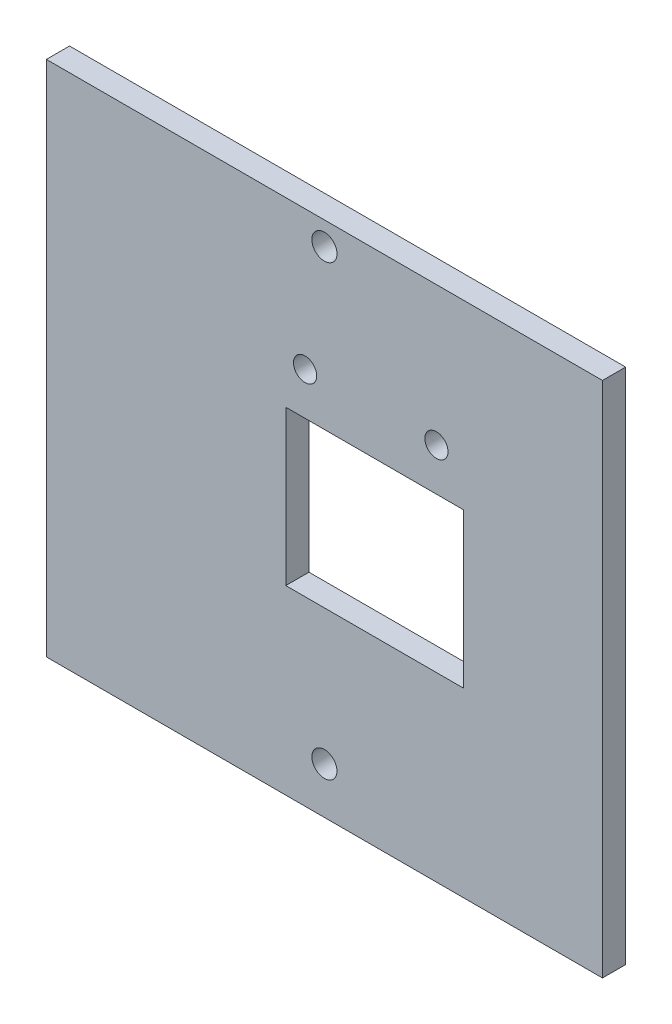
from build123d import *

# Parameters (mm, degrees)
CROQUIS1_W              = 72
CROQUIS1_H              = 67
SALIENTE_EXTRUIR1_DEPTH = 3
CROQUIS4_R              = 1.625
CROQUIS4_R_2            = 1.5
CORTAR_EXTRUIR2_DEPTH   = 3


with BuildPart() as part:
    # Croquis1 → Saliente-Extruir1 (new body)
    with BuildSketch(Plane.XY):
        with Locations((83.049688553, -19.639954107)):
            Rectangle(CROQUIS1_W, CROQUIS1_H)
    extrude(amount=SALIENTE_EXTRUIR1_DEPTH)

    # Croquis4 → Cortar-Extruir2 (cut)
    with BuildSketch(Plane(origin=(0, 0, 0), x_dir=(-1, 0, 0), z_dir=(0, 0, -1))):
        with Locations((-83.049688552, -47.139954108)):
            Circle(CROQUIS4_R)
        with Locations((-83.049688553, 10.860045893)):
            Circle(CROQUIS4_R)
        with Locations((-97.549688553, -4.139954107)):
            Circle(CROQUIS4_R_2)
        with Locations((-80.549688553, -4.139954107)):
            Circle(CROQUIS4_R_2)
        Polygon((-81.049688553, -9.639954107), (-78.049688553, -9.639954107), (-78.049688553, -29.639954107), (-81.049688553, -29.639954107), (-101.049688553, -29.639954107), (-101.049688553, -9.639954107), align=None)
    extrude(amount=-CORTAR_EXTRUIR2_DEPTH, mode=Mode.SUBTRACT)


solid = part.part
